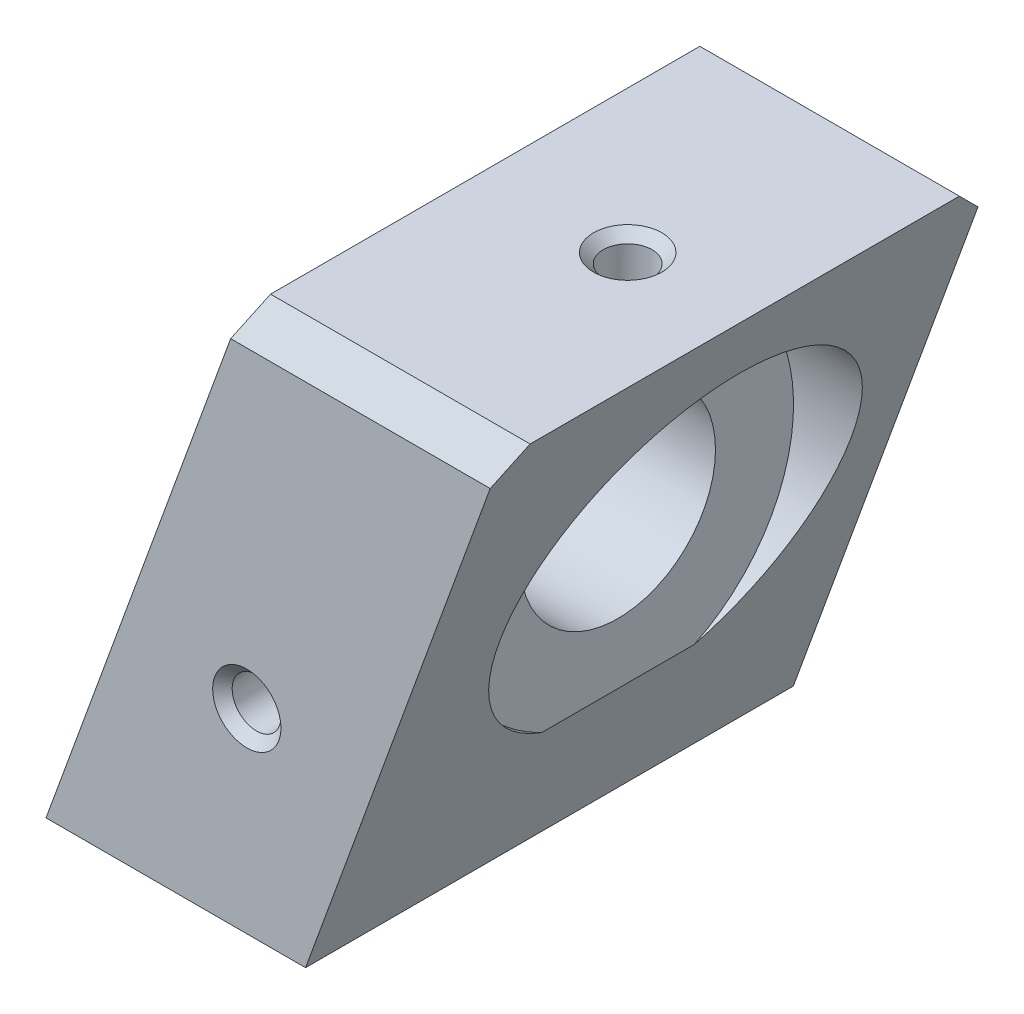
from build123d import *

# Parameters (mm, degrees)
EXTRUSION1_DEPTH                    = 25
DIAM_TRE_DU_PER_AGE_8_5_8_5_1_D     = 8.5
DIAM_TRE_DU_PER_AGE_8_5_8_5_1_DEPTH = 24.5
DIAM_TRE_DU_PER_AGE_8_5_8_5_1_TIP   = 2.553657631
CHANFREIN1_SIZE                     = 1
CHANFREIN2_SIZE                     = 3
DIAM_TRE_DU_PER_AGE_5_0_5_1_D       = 5
DIAM_TRE_DU_PER_AGE_5_0_5_1_DEPTH   = 15
DIAM_TRE_DU_PER_AGE_5_0_5_1_TIP     = 1.502151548
CHANFREIN3_SIZE                     = 1
DIAM_TRE_DU_PER_AGE_5_0_5_2_D       = 5
DIAM_TRE_DU_PER_AGE_5_0_5_2_DEPTH   = 15
DIAM_TRE_DU_PER_AGE_5_0_5_2_TIP     = 1.502151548
CHANFREIN4_SIZE                     = 1
DIAM_TRE_DU_PER_AGE_5_0_5_3_D       = 5
DIAM_TRE_DU_PER_AGE_5_0_5_3_DEPTH   = 15
DIAM_TRE_DU_PER_AGE_5_0_5_3_TIP     = 1.502151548
CHANFREIN5_SIZE                     = 1
ESQUISSE11_R                        = 4.25
EXTRUSION2_DEPTH                    = 77.313079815


with BuildPart() as part:
    # Esquisse1 → Extrusion1 (new, symmetric)
    with BuildSketch(Plane.XY):
        Polygon((0, 0), (26.604444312, 0), (46.622807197, 55), (20.018362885, 55), align=None)
    extrude(amount=EXTRUSION1_DEPTH, both=True)

    # Diam_tre du per_age _8.5 _8.5_1
    with Locations(Plane.XZ):
        with Locations((15, 13.6), (15, -16.4)):
            Hole(DIAM_TRE_DU_PER_AGE_8_5_8_5_1_D / 2, depth=DIAM_TRE_DU_PER_AGE_8_5_8_5_1_DEPTH)
            with Locations((0, 0, -(DIAM_TRE_DU_PER_AGE_8_5_8_5_1_DEPTH + DIAM_TRE_DU_PER_AGE_8_5_8_5_1_TIP / 2))):  # 118° drill point
                Cone(0, DIAM_TRE_DU_PER_AGE_8_5_8_5_1_D / 2, DIAM_TRE_DU_PER_AGE_8_5_8_5_1_TIP, mode=Mode.SUBTRACT)

    # Chanfrein1
    chanfrein1_edges = [part.edges().sort_by_distance(p)[0] for p in [
        (19.25, 0, -16.4),
        (19.25, 0, 13.6),
    ]]
    chamfer(chanfrein1_edges, length=CHANFREIN1_SIZE)

    # Esquisse4 → Enl_vement de mati_re-R_volution1 (revolve, cut)
    with BuildSketch(Plane.XY.offset(-2), mode=Mode.PRIVATE) as enl_vement_de_mati_re_r_volution1_sk:
        Polygon((0, 30), (0, 12), (17, 12), (17, 20), (31.622807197, 20), (31.622807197, 12), (46.622807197, 12), (46.622807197, 30), align=None)
    revolve(enl_vement_de_mati_re_r_volution1_sk.sketch.rotate(Axis((-32.846713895, 30, -2), (1, 0, 0)), 270), axis=Axis((-32.846713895, 30, -2), (1, 0, 0)), mode=Mode.SUBTRACT)

    # Chanfrein2
    chanfrein2_edges = [part.edges().sort_by_distance(p)[0] for p in [
        (33.320585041, 55, 25),
        (33.320585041, 55, -25),
    ]]
    chamfer(chanfrein2_edges, length=CHANFREIN2_SIZE)

    # Diam_tre du per_age _5.0 _5_1
    with Locations(Plane.XY.offset(25)):
        with Locations((20.581626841, 20)):
            Hole(DIAM_TRE_DU_PER_AGE_5_0_5_1_D / 2, depth=DIAM_TRE_DU_PER_AGE_5_0_5_1_DEPTH)
            with Locations((0, 0, -(DIAM_TRE_DU_PER_AGE_5_0_5_1_DEPTH + DIAM_TRE_DU_PER_AGE_5_0_5_1_TIP / 2))):  # 118° drill point
                Cone(0, DIAM_TRE_DU_PER_AGE_5_0_5_1_D / 2, DIAM_TRE_DU_PER_AGE_5_0_5_1_TIP, mode=Mode.SUBTRACT)

    # Chanfrein3
    chanfrein3_edges = [part.edges().sort_by_distance(p)[0] for p in [
        (23.081626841, 20, 25),
    ]]
    chamfer(chanfrein3_edges, length=CHANFREIN3_SIZE)

    # Diam_tre du per_age _5.0 _5_2
    with Locations(Plane(origin=(0, 0, -25), x_dir=(-1, 0, 0), z_dir=(0, 0, -1))):
        with Locations((-20.581626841, 20)):
            Hole(DIAM_TRE_DU_PER_AGE_5_0_5_2_D / 2, depth=DIAM_TRE_DU_PER_AGE_5_0_5_2_DEPTH)
            with Locations((0, 0, -(DIAM_TRE_DU_PER_AGE_5_0_5_2_DEPTH + DIAM_TRE_DU_PER_AGE_5_0_5_2_TIP / 2))):  # 118° drill point
                Cone(0, DIAM_TRE_DU_PER_AGE_5_0_5_2_D / 2, DIAM_TRE_DU_PER_AGE_5_0_5_2_TIP, mode=Mode.SUBTRACT)

    # Chanfrein4
    chanfrein4_edges = [part.edges().sort_by_distance(p)[0] for p in [
        (18.081626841, 20, -25),
    ]]
    chamfer(chanfrein4_edges, length=CHANFREIN4_SIZE)

    # Diam_tre du per_age _5.0 _5_3
    with Locations(Plane(origin=(0, 55, 0), x_dir=(-1, 0, 0), z_dir=(0, 1, 0))):
        with Locations((-34.622807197, 0)):
            Hole(DIAM_TRE_DU_PER_AGE_5_0_5_3_D / 2, depth=DIAM_TRE_DU_PER_AGE_5_0_5_3_DEPTH)
            with Locations((0, 0, -(DIAM_TRE_DU_PER_AGE_5_0_5_3_DEPTH + DIAM_TRE_DU_PER_AGE_5_0_5_3_TIP / 2))):  # 118° drill point
                Cone(0, DIAM_TRE_DU_PER_AGE_5_0_5_3_D / 2, DIAM_TRE_DU_PER_AGE_5_0_5_3_TIP, mode=Mode.SUBTRACT)

    # Chanfrein5
    chanfrein5_edges = [part.edges().sort_by_distance(p)[0] for p in [
        (32.122807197, 55, 0),
    ]]
    chamfer(chanfrein5_edges, length=CHANFREIN5_SIZE)

    # Esquisse11 → Extrusion2 (cut, through all)
    with BuildSketch(Plane.XZ):
        with Locations(Location((8, -2, 0), (0, 0, 270))):
            Circle(ESQUISSE11_R)
    extrude(amount=-EXTRUSION2_DEPTH, mode=Mode.SUBTRACT)


solid = part.part
